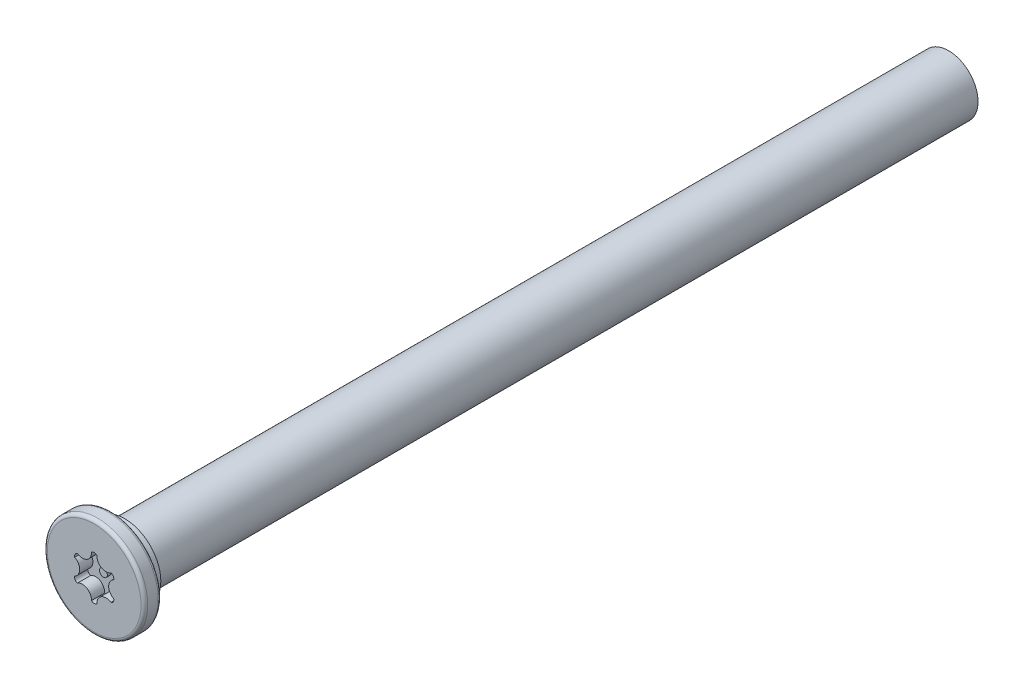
from build123d import *

# Parameters (mm, degrees)
SKETCH2_W           = 1.3
SKETCH2_H           = 3.81
SKETCH2_W_2         = 12.7
SKETCH2_H_2         = 2.23
CUT_EXTRUDE3_DEPTH  = 1
FILLET12_R          = 0.254
CUT_EXTRUDE6_START  = -12.7
SKETCH7_R           = 2.23
CUT_EXTRUDE6_DEPTH  = 12.7
SKETCH11_R          = 2.738000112
SKETCH11_R_2        = 2.230000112
BOSS_EXTRUDE1_DEPTH = 1.016
SKETCH12_R          = 2.230000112
BOSS_EXTRUDE2_DEPTH = 12.7
SKETCH14_R          = 0.3
BOSS_EXTRUDE4_DEPTH = 0.3
CUT_EXTRUDE7_START  = -12.7
SKETCH15_R          = 2.230000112
CUT_EXTRUDE7_DEPTH  = 12.7
SKETCH16_R          = 2.230000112
BOSS_EXTRUDE5_DEPTH = 63.5


with BuildPart() as part:
    # Sketch2 → Revolve1 (revolve)
    with BuildSketch(Plane(origin=(0, 0, 0), x_dir=(0, 0, -1), z_dir=(1, 0, 0)), mode=Mode.PRIVATE) as revolve1_sk:
        with Locations((0.65, 1.905)):
            Rectangle(SKETCH2_W, SKETCH2_H)
        with Locations((7.65, 1.115)):
            Rectangle(SKETCH2_W_2, SKETCH2_H_2)
    revolve(revolve1_sk.sketch.rotate(Axis((0, 0, -1.3), (0, 0, -1)), 90), axis=Axis((0, 0, -1.3), (0, 0, -1)))

    # Sketch3 → Cut-Extrude3 (cut)
    with BuildSketch(Plane.XY):
        with BuildLine():
            ThreePointArc((-0.205060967, 1.589373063), (0, 1.674312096), (0.205060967, 1.589373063))
            ThreePointArc((0.205060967, 1.589373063), (0.54882888, 0.950599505), (1.273906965, 0.972274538))
            ThreePointArc((1.273906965, 0.972274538), (1.449996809, 0.837156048), (1.478967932, 0.617098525))
            ThreePointArc((1.478967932, 0.617098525), (1.097657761, 0), (1.478967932, -0.617098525))
            ThreePointArc((1.478967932, -0.617098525), (1.449996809, -0.837156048), (1.273906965, -0.972274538))
            ThreePointArc((1.273906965, -0.972274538), (0.54882888, -0.950599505), (0.205060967, -1.589373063))
            ThreePointArc((0.205060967, -1.589373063), (0, -1.674312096), (-0.205060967, -1.589373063))
            ThreePointArc((-0.205060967, -1.589373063), (-0.54882888, -0.950599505), (-1.273906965, -0.972274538))
            ThreePointArc((-1.273906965, -0.972274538), (-1.449996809, -0.837156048), (-1.478967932, -0.617098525))
            ThreePointArc((-1.478967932, -0.617098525), (-1.097657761, 0), (-1.478967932, 0.617098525))
            ThreePointArc((-1.478967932, 0.617098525), (-1.449996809, 0.837156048), (-1.273906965, 0.972274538))
            ThreePointArc((-1.273906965, 0.972274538), (-0.54882888, 0.950599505), (-0.205060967, 1.589373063))
        make_face()
    extrude(amount=-CUT_EXTRUDE3_DEPTH, mode=Mode.SUBTRACT)

    # Fillet12
    fillet12_edges = [part.edges().sort_by_distance(p)[0] for p in [
        (-3.81, 0, 0),
        (-3.81, 0, -1.3),
    ]]
    fillet(fillet12_edges, radius=FILLET12_R)

    # Sketch7 → Cut-Extrude6 (cut)
    with BuildSketch(Plane(origin=(0, 0, -14), x_dir=(-1, 0, 0), z_dir=(0, 0, -1)).offset(CUT_EXTRUDE6_START)):
        Circle(SKETCH7_R)
    extrude(amount=CUT_EXTRUDE6_DEPTH, mode=Mode.SUBTRACT)

    # Sketch11 → Boss-Extrude1 (add)
    with BuildSketch(Plane(origin=(0, 0, -1.3), x_dir=(-1, 0, 0), z_dir=(0, 0, -1))):
        with Locations(Location((0, 0, 0), (0, 0, 180))):
            Circle(SKETCH11_R)
        Circle(SKETCH11_R_2, mode=Mode.SUBTRACT)
    extrude(amount=BOSS_EXTRUDE1_DEPTH)

    # Sketch12 → Boss-Extrude2 (add)
    with BuildSketch(Plane(origin=(0, 0, -1.3), x_dir=(-1, 0, 0), z_dir=(0, 0, -1))):
        Circle(SKETCH12_R)
    extrude(amount=BOSS_EXTRUDE2_DEPTH)

    # Sketch14 → Boss-Extrude4 (add)
    with BuildSketch(Plane.XY.offset(-1)):
        Circle(SKETCH14_R)
    extrude(amount=BOSS_EXTRUDE4_DEPTH)

    # Sketch15 → Cut-Extrude7 (cut)
    with BuildSketch(Plane(origin=(0, 0, -14), x_dir=(-1, 0, 0), z_dir=(0, 0, -1)).offset(CUT_EXTRUDE7_START)):
        Circle(SKETCH15_R)
    extrude(amount=CUT_EXTRUDE7_DEPTH, mode=Mode.SUBTRACT)

    # Sketch16 → Boss-Extrude5 (add)
    with BuildSketch(Plane(origin=(0, 0, -1.3), x_dir=(-1, 0, 0), z_dir=(0, 0, -1))):
        Circle(SKETCH16_R)
    extrude(amount=BOSS_EXTRUDE5_DEPTH)


solid = part.part
